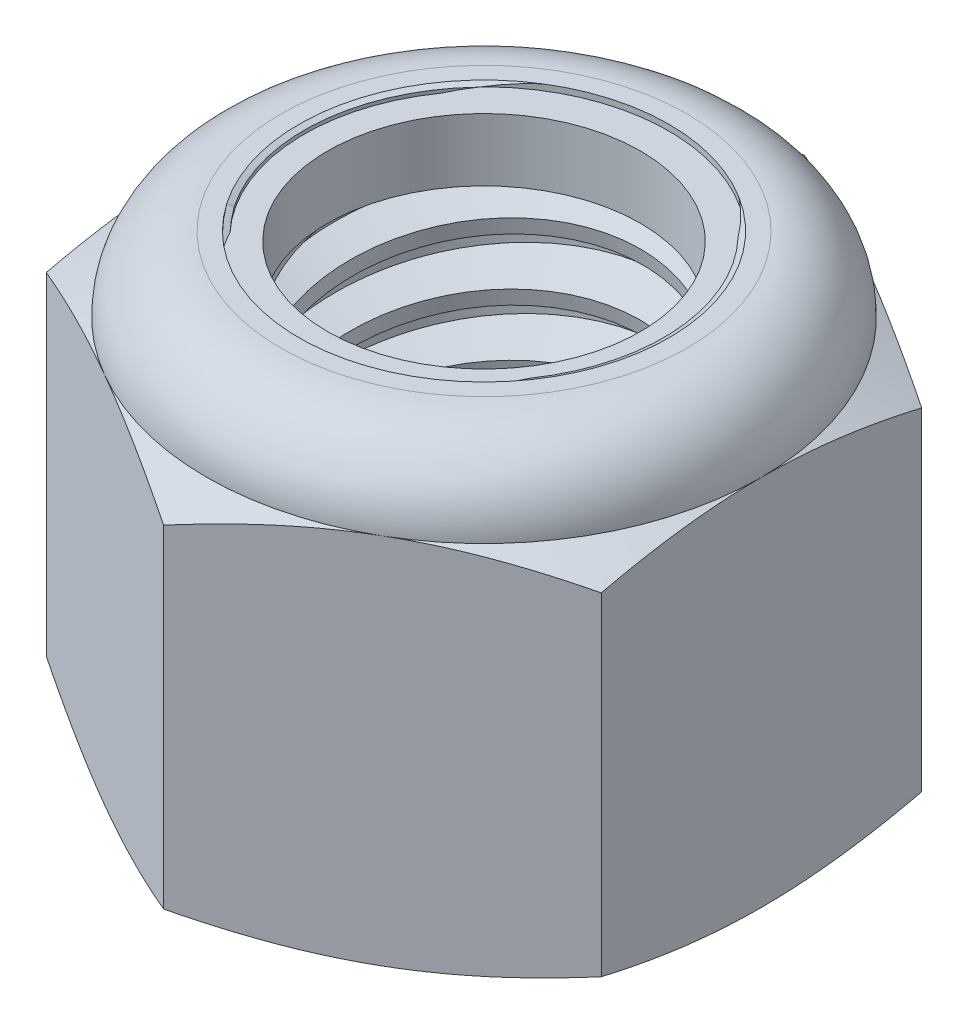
from build123d import *

# Parameters (mm, degrees)
EXTRUDE1_DEPTH      = 11.509375
SKETCH2_W           = 4.7625
SKETCH2_H           = 11.509375
LPATTERN1_COUNT     = 7
LPATTERN1_PITCH     = 1.5875
LPATTERN1_COL_COUNT = 2
LPATTERN1_COL_PITCH = 1.5875


with BuildPart() as part:
    # Sketch1 → Extrude1 (new body)
    with BuildSketch(Plane(origin=(0, 0, 0), x_dir=(1, 0, 0), z_dir=(0, 1, 0))):
        Polygon((0, 8.248891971), (-7.14375, 4.124445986), (-7.14375, -4.124445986), (0, -8.248891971), (7.14375, -4.124445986), (7.14375, 4.124445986), align=None)
    extrude(amount=EXTRUDE1_DEPTH)

    # Sketch4 → Cut-Revolve2 (revolve, cut)
    with BuildSketch(Plane(origin=(0, 0, 0), x_dir=(0, 0, -1), z_dir=(1, 0, 0)), mode=Mode.PRIVATE) as cut_revolve2_sk:
        Polygon((0, 11.509375), (4.7625, 11.509375), (4.029111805, 11.167390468), (4.029111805, 0.341984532), (4.7625, 0), (0, 0), align=None)
    revolve(cut_revolve2_sk.sketch.rotate(Axis((0, 11.509375, 0), (0, 1, 0)), 55.157981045), axis=Axis((0, 11.509375, 0), (0, 1, 0)), mode=Mode.SUBTRACT)


with BuildPart() as body_2:
    # Sketch2 → Revolve1 (revolve)
    with BuildSketch(Plane(origin=(0, 0, 0), x_dir=(0, 0, -1), z_dir=(1, 0, 0))):
        with Locations((2.38125, 5.7546875)):
            Rectangle(SKETCH2_W, SKETCH2_H)
    revolve(axis=Axis((0, -4.7625, 0), (0, 1, 0)))

    # Sketch3 → Cut-Revolve1 (revolve, cut)
    with BuildSketch(Plane(origin=(0, 0, 0), x_dir=(0, 0, -1), z_dir=(1, 0, 0)), mode=Mode.PRIVATE) as cut_revolve1_sk:
        Polygon((4.795122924, 11.313637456), (5.023483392, 9.943474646), (4.094357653, 10.291557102), (4.029111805, 10.68303219), align=None)
    cut_revolve1 = revolve(cut_revolve1_sk.sketch.rotate(Axis((0, 11.509375, 0.28317269), (0, -0.9863939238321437, -0.1643989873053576)), 180), axis=Axis((0, 11.509375, 0.28317269), (0, -0.9863939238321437, -0.1643989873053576)), mode=Mode.SUBTRACT)

    # LPattern1: Cut-Revolve1 ×7
    with Locations(*[(0, -i * LPATTERN1_PITCH, 0) for i in range(1, LPATTERN1_COUNT)]):
        add(cut_revolve1, mode=Mode.SUBTRACT)

    # LPattern1 col: Cut-Revolve1 ×2
    with Locations(*[(0, i * LPATTERN1_COL_PITCH, 0) for i in range(1, LPATTERN1_COL_COUNT)]):
        add(cut_revolve1, mode=Mode.SUBTRACT)


with BuildPart() as part_1:
    add(part.part)

    # Combine1: cut body 2
    add(body_2.part, mode=Mode.SUBTRACT)

    # Sketch5 → Cut-Revolve3 (revolve, cut)
    with BuildSketch(Plane(origin=(0, 0, 0), x_dir=(0, 0, -1), z_dir=(1, 0, 0)), mode=Mode.PRIVATE) as cut_revolve3_sk:
        with BuildLine():
            Line((0, 0), (7.14375, 0))
            Line((7.14375, 0), (8.248891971, 0.515336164))
            Line((8.248891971, 0.515336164), (8.248891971, 9.075809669))
            Line((8.248891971, 9.075809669), (7.14375, 9.591145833))
            ThreePointArc((7.14375, 9.591145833), (6.581913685, 10.947538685), (5.225520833, 11.509375))
            Line((5.225520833, 11.509375), (5.225520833, 12.779375))
            Line((5.225520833, 12.779375), (9.518891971, 12.779375))
            Line((9.518891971, 12.779375), (9.518891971, -1.27))
            Line((9.518891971, -1.27), (0, -1.27))
            Line((0, -1.27), (0, 0))
        make_face()
    revolve(cut_revolve3_sk.sketch.rotate(Axis((0, 0, 0), (0, 1, 0)), 55.157981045), axis=Axis((0, 0, 0), (0, 1, 0)), mode=Mode.SUBTRACT)

    # Sketch6 → Cut-Revolve4 (revolve, cut)
    with BuildSketch(Plane(origin=(0, 0, 0), x_dir=(0, 0, -1), z_dir=(1, 0, 0)), mode=Mode.PRIVATE) as cut_revolve4_sk:
        with BuildLine():
            Line((0, 9.591145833), (6.99135, 9.591145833))
            ThreePointArc((6.99135, 9.591145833), (6.474150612, 10.839775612), (5.225520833, 11.356975))
            Line((5.225520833, 11.356975), (4.627316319, 11.356975))
            Line((4.627316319, 11.356975), (4.627316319, 12.779375))
            Line((4.627316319, 12.779375), (0, 12.779375))
            Line((0, 12.779375), (0, 9.591145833))
        make_face()
    revolve(cut_revolve4_sk.sketch.rotate(Axis((0, 12.779375, 0), (0, 1, 0)), 55.157981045), axis=Axis((0, 12.779375, 0), (0, 1, 0)), mode=Mode.SUBTRACT)


with BuildPart() as body_2_2:
    # Sketch7 → Revolve2 (revolve)
    with BuildSketch(Plane(origin=(0, 0, 0), x_dir=(0, 0, -1), z_dir=(1, 0, 0)), mode=Mode.PRIVATE) as revolve2_sk:
        with BuildLine():
            Line((4.029111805, 9.667345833), (6.913430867, 9.667345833))
            ThreePointArc((6.913430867, 9.667345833), (6.39301751, 10.812537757), (5.225520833, 11.280775))
            Line((5.225520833, 11.280775), (4.029111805, 11.280775))
            Line((4.029111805, 11.280775), (4.029111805, 9.667345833))
        make_face()
    revolve(revolve2_sk.sketch.rotate(Axis((0, 9.667345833, 0), (0, 1, 0)), 55.157981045), axis=Axis((0, 9.667345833, 0), (0, 1, 0)))


solid = Compound([part_1.part, body_2_2.part])
